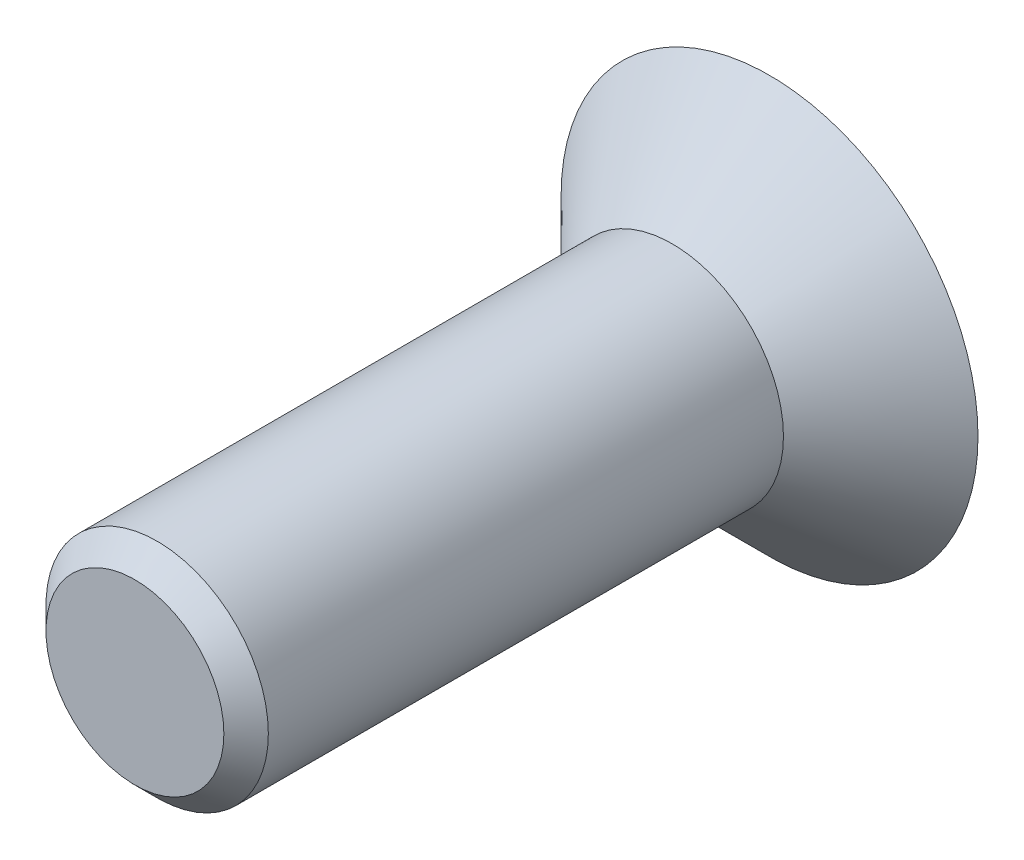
from build123d import *

# Parameters (mm, degrees)
FENTE1_DEPTH    = 5
ESQUISSE3_W     = 6
ESQUISSE3_H     = 29
CHANFREIN1_SIZE = 1.2


with BuildPart() as part:
    # Esquisse1 → Base-R_volution (revolve)
    with BuildSketch(Plane(origin=(0, 0, 0), x_dir=(1, 0, 0), z_dir=(0, 1, 0)), mode=Mode.PRIVATE) as base_r_volution_sk:
        Polygon((6, 0), (11.25, 5.25), (0, 5.25), (0, 0), align=None)
    revolve(base_r_volution_sk.sketch.rotate(Axis((0, 0, 0), (0, 0, -1)), 180), axis=Axis((0, 0, 0), (0, 0, -1)))

    # Esquisse2 → fente1 (cut)
    with BuildSketch(Plane.XY.offset(-5.25)):
        Polygon((4, -2.309401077), (4, 2.309401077), (0, 4.618802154), (-4, 2.309401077), (-4, -2.309401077), (0, -4.618802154), align=None)
    extrude(amount=FENTE1_DEPTH, mode=Mode.SUBTRACT)

    # Esquisse3 → Boss.-R_vol.1 (revolve)
    with BuildSketch(Plane(origin=(0, 0, 0), x_dir=(1, 0, 0), z_dir=(0, 1, 0))):
        with Locations((3, -14.5)):
            Rectangle(ESQUISSE3_W, ESQUISSE3_H)
    revolve(axis=Axis((0, 0, 0), (0, 0, 1)))

    # Chanfrein1
    chanfrein1_edges = [part.edges().sort_by_distance(p)[0] for p in [
        (-6, 0, 29),
    ]]
    chamfer(chanfrein1_edges, length=CHANFREIN1_SIZE)


solid = part.part
